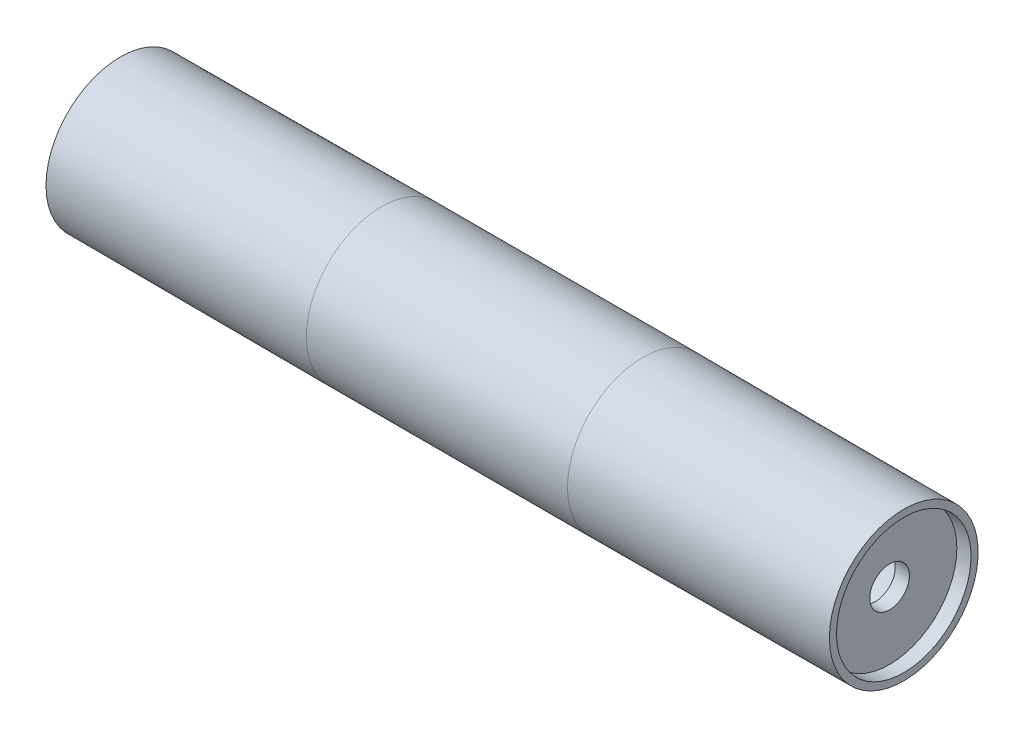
ISO-10303-21;
HEADER;
FILE_DESCRIPTION(('STEP AP214'),'2;1');
FILE_NAME('part.step','',(''),(''),'','','');
FILE_SCHEMA(('AUTOMOTIVE_DESIGN { 1 0 10303 214 1 1 1 1 }'));
ENDSEC;
DATA;
#1=APPLICATION_CONTEXT('core data for automotive mechanical design processes');
#2=APPLICATION_PROTOCOL_DEFINITION('international standard','automotive_design',2000,#1);
#3=PRODUCT_CONTEXT('',#1,'mechanical');
#4=PRODUCT('Part','Part','',(#3));
#5=PRODUCT_RELATED_PRODUCT_CATEGORY('part','',(#4));
#6=PRODUCT_DEFINITION_FORMATION('','',#4);
#7=PRODUCT_DEFINITION_CONTEXT('part definition',#1,'design');
#8=PRODUCT_DEFINITION('design','',#6,#7);
#9=PRODUCT_DEFINITION_SHAPE('','',#8);
#10=(LENGTH_UNIT() NAMED_UNIT(*) SI_UNIT(.MILLI.,.METRE.));
#11=(NAMED_UNIT(*) PLANE_ANGLE_UNIT() SI_UNIT($,.RADIAN.));
#12=(NAMED_UNIT(*) SI_UNIT($,.STERADIAN.) SOLID_ANGLE_UNIT());
#13=UNCERTAINTY_MEASURE_WITH_UNIT(LENGTH_MEASURE(1.E-05),#10,'distance_accuracy_value','');
#14=(GEOMETRIC_REPRESENTATION_CONTEXT(3) GLOBAL_UNCERTAINTY_ASSIGNED_CONTEXT((#13)) GLOBAL_UNIT_ASSIGNED_CONTEXT((#10,
#11,#12)) REPRESENTATION_CONTEXT('',''));
#15=CARTESIAN_POINT('',(0.,0.,0.));
#16=DIRECTION('',(0.,0.,1.));
#17=DIRECTION('',(1.,0.,0.));
#18=AXIS2_PLACEMENT_3D('',#15,#16,#17);
#19=CARTESIAN_POINT('',(-457.495284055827,0.,0.));
#20=DIRECTION('',(-1.,0.,0.));
#21=DIRECTION('',(0.,0.,1.));
#22=AXIS2_PLACEMENT_3D('',#19,#20,#21);
#23=CYLINDRICAL_SURFACE('',#22,118.5);
#24=CARTESIAN_POINT('',(-665.,0.,0.));
#25=DIRECTION('',(-1.,0.,0.));
#26=DIRECTION('',(0.,0.,1.));
#27=AXIS2_PLACEMENT_3D('',#24,#25,#26);
#28=CIRCLE('',#27,118.5);
#29=CARTESIAN_POINT('',(-665.,0.,118.5));
#30=VERTEX_POINT('',#29);
#31=EDGE_CURVE('E10',#30,#30,#28,.T.);
#32=ORIENTED_EDGE('',*,*,#31,.F.);
#33=EDGE_LOOP('',(#32));
#34=FACE_BOUND('',#33,.T.);
#35=CARTESIAN_POINT('',(-690.,0.,0.));
#36=DIRECTION('',(-1.,0.,0.));
#37=DIRECTION('',(0.,0.,1.));
#38=AXIS2_PLACEMENT_3D('',#35,#36,#37);
#39=CIRCLE('',#38,118.5);
#40=CARTESIAN_POINT('',(-690.,0.,118.5));
#41=VERTEX_POINT('',#40);
#42=EDGE_CURVE('E72',#41,#41,#39,.T.);
#43=ORIENTED_EDGE('',*,*,#42,.T.);
#44=EDGE_LOOP('',(#43));
#45=FACE_BOUND('',#44,.T.);
#46=ADVANCED_FACE('F34',(#34,#45),#23,.F.);
#47=CARTESIAN_POINT('',(230.,0.,0.));
#48=DIRECTION('',(-1.,0.,0.));
#49=DIRECTION('',(0.,0.,1.));
#50=AXIS2_PLACEMENT_3D('',#47,#48,#49);
#51=CONICAL_SURFACE('',#50,132.5,0.00326085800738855);
#52=CARTESIAN_POINT('',(690.,0.,0.));
#53=DIRECTION('',(-1.,0.,0.));
#54=DIRECTION('',(0.,0.,1.));
#55=AXIS2_PLACEMENT_3D('',#52,#53,#54);
#56=CIRCLE('',#55,131.);
#57=CARTESIAN_POINT('',(690.,0.,131.));
#58=VERTEX_POINT('',#57);
#59=EDGE_CURVE('E57',#58,#58,#56,.T.);
#60=ORIENTED_EDGE('',*,*,#59,.T.);
#61=EDGE_LOOP('',(#60));
#62=FACE_BOUND('',#61,.T.);
#63=CARTESIAN_POINT('',(230.,0.,0.));
#64=DIRECTION('',(-1.,0.,0.));
#65=DIRECTION('',(0.,0.,1.));
#66=AXIS2_PLACEMENT_3D('',#63,#64,#65);
#67=CIRCLE('',#66,132.5);
#68=CARTESIAN_POINT('',(230.,0.,132.5));
#69=VERTEX_POINT('',#68);
#70=EDGE_CURVE('E47',#69,#69,#67,.T.);
#71=ORIENTED_EDGE('',*,*,#70,.F.);
#72=EDGE_LOOP('',(#71));
#73=FACE_BOUND('',#72,.T.);
#74=ADVANCED_FACE('F36',(#62,#73),#51,.T.);
#75=CARTESIAN_POINT('',(-457.495284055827,0.,0.));
#76=DIRECTION('',(-1.,0.,0.));
#77=DIRECTION('',(0.,0.,1.));
#78=AXIS2_PLACEMENT_3D('',#75,#76,#77);
#79=CYLINDRICAL_SURFACE('',#78,132.5);
#80=ORIENTED_EDGE('',*,*,#70,.T.);
#81=EDGE_LOOP('',(#80));
#82=FACE_BOUND('',#81,.T.);
#83=CARTESIAN_POINT('',(-230.,0.,0.));
#84=DIRECTION('',(-1.,0.,0.));
#85=DIRECTION('',(0.,0.,1.));
#86=AXIS2_PLACEMENT_3D('',#83,#84,#85);
#87=CIRCLE('',#86,132.5);
#88=CARTESIAN_POINT('',(-230.,0.,132.5));
#89=VERTEX_POINT('',#88);
#90=EDGE_CURVE('E78',#89,#89,#87,.T.);
#91=ORIENTED_EDGE('',*,*,#90,.F.);
#92=EDGE_LOOP('',(#91));
#93=FACE_BOUND('',#92,.T.);
#94=ADVANCED_FACE('F84',(#82,#93),#79,.T.);
#95=CARTESIAN_POINT('',(-690.,0.,0.));
#96=DIRECTION('',(1.,0.,0.));
#97=DIRECTION('',(0.,0.,-1.));
#98=AXIS2_PLACEMENT_3D('',#95,#96,#97);
#99=CONICAL_SURFACE('',#98,131.,0.00326085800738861);
#100=ORIENTED_EDGE('',*,*,#90,.T.);
#101=EDGE_LOOP('',(#100));
#102=FACE_BOUND('',#101,.T.);
#103=CARTESIAN_POINT('',(-690.,0.,0.));
#104=DIRECTION('',(-1.,0.,0.));
#105=DIRECTION('',(0.,0.,1.));
#106=AXIS2_PLACEMENT_3D('',#103,#104,#105);
#107=CIRCLE('',#106,131.);
#108=CARTESIAN_POINT('',(-690.,0.,131.));
#109=VERTEX_POINT('',#108);
#110=EDGE_CURVE('E75',#109,#109,#107,.T.);
#111=ORIENTED_EDGE('',*,*,#110,.F.);
#112=EDGE_LOOP('',(#111));
#113=FACE_BOUND('',#112,.T.);
#114=ADVANCED_FACE('F93',(#102,#113),#99,.T.);
#115=CARTESIAN_POINT('',(-690.,-118.5,0.));
#116=DIRECTION('',(-1.,0.,0.));
#117=DIRECTION('',(0.,0.,1.));
#118=AXIS2_PLACEMENT_3D('',#115,#116,#117);
#119=PLANE('',#118);
#120=ORIENTED_EDGE('',*,*,#110,.T.);
#121=EDGE_LOOP('',(#120));
#122=FACE_BOUND('',#121,.T.);
#123=ORIENTED_EDGE('',*,*,#42,.F.);
#124=EDGE_LOOP('',(#123));
#125=FACE_BOUND('',#124,.T.);
#126=ADVANCED_FACE('F112',(#122,#125),#119,.T.);
#127=CARTESIAN_POINT('',(665.,0.,0.));
#128=DIRECTION('',(1.,0.,0.));
#129=DIRECTION('',(0.,0.,-1.));
#130=AXIS2_PLACEMENT_3D('',#127,#128,#129);
#131=CIRCLE('',#130,118.5);
#132=CARTESIAN_POINT('',(665.,0.,-118.5));
#133=VERTEX_POINT('',#132);
#134=EDGE_CURVE('E42',#133,#133,#131,.T.);
#135=ORIENTED_EDGE('',*,*,#134,.F.);
#136=EDGE_LOOP('',(#135));
#137=FACE_BOUND('',#136,.T.);
#138=CARTESIAN_POINT('',(690.,0.,0.));
#139=DIRECTION('',(-1.,0.,0.));
#140=DIRECTION('',(0.,0.,1.));
#141=AXIS2_PLACEMENT_3D('',#138,#139,#140);
#142=CIRCLE('',#141,118.5);
#143=CARTESIAN_POINT('',(690.,0.,118.5));
#144=VERTEX_POINT('',#143);
#145=EDGE_CURVE('E69',#144,#144,#142,.T.);
#146=ORIENTED_EDGE('',*,*,#145,.F.);
#147=EDGE_LOOP('',(#146));
#148=FACE_BOUND('',#147,.T.);
#149=ADVANCED_FACE('F96',(#137,#148),#23,.F.);
#150=CARTESIAN_POINT('',(690.,-118.5,0.));
#151=DIRECTION('',(1.,0.,0.));
#152=DIRECTION('',(0.,0.,-1.));
#153=AXIS2_PLACEMENT_3D('',#150,#151,#152);
#154=PLANE('',#153);
#155=ORIENTED_EDGE('',*,*,#145,.T.);
#156=EDGE_LOOP('',(#155));
#157=FACE_BOUND('',#156,.T.);
#158=ORIENTED_EDGE('',*,*,#59,.F.);
#159=EDGE_LOOP('',(#158));
#160=FACE_BOUND('',#159,.T.);
#161=ADVANCED_FACE('F100',(#157,#160),#154,.T.);
#162=CARTESIAN_POINT('',(665.,0.,0.));
#163=DIRECTION('',(1.,0.,0.));
#164=DIRECTION('',(0.,0.,-1.));
#165=AXIS2_PLACEMENT_3D('',#162,#163,#164);
#166=PLANE('',#165);
#167=CARTESIAN_POINT('',(665.,0.,0.));
#168=DIRECTION('',(1.,0.,0.));
#169=DIRECTION('',(0.,0.,-1.));
#170=AXIS2_PLACEMENT_3D('',#167,#168,#169);
#171=CIRCLE('',#170,35.);
#172=CARTESIAN_POINT('',(665.,0.,-35.));
#173=VERTEX_POINT('',#172);
#174=EDGE_CURVE('E215',#173,#173,#171,.T.);
#175=ORIENTED_EDGE('',*,*,#174,.F.);
#176=EDGE_LOOP('',(#175));
#177=FACE_BOUND('',#176,.T.);
#178=ORIENTED_EDGE('',*,*,#134,.T.);
#179=EDGE_LOOP('',(#178));
#180=FACE_BOUND('',#179,.T.);
#181=ADVANCED_FACE('F102',(#177,#180),#166,.T.);
#182=CARTESIAN_POINT('',(-665.,0.,0.));
#183=DIRECTION('',(-1.,0.,0.));
#184=DIRECTION('',(0.,0.,-1.));
#185=AXIS2_PLACEMENT_3D('',#182,#183,#184);
#186=PLANE('',#185);
#187=CARTESIAN_POINT('',(-665.,0.,0.));
#188=DIRECTION('',(-1.,0.,0.));
#189=DIRECTION('',(0.,0.,1.));
#190=AXIS2_PLACEMENT_3D('',#187,#188,#189);
#191=CIRCLE('',#190,35.);
#192=CARTESIAN_POINT('',(-665.,0.,35.));
#193=VERTEX_POINT('',#192);
#194=EDGE_CURVE('E53',#193,#193,#191,.T.);
#195=ORIENTED_EDGE('',*,*,#194,.F.);
#196=EDGE_LOOP('',(#195));
#197=FACE_BOUND('',#196,.T.);
#198=ORIENTED_EDGE('',*,*,#31,.T.);
#199=EDGE_LOOP('',(#198));
#200=FACE_BOUND('',#199,.T.);
#201=ADVANCED_FACE('F109',(#197,#200),#186,.T.);
#202=CARTESIAN_POINT('',(-690.,0.,0.));
#203=DIRECTION('',(1.,0.,0.));
#204=DIRECTION('',(0.,0.,-1.));
#205=AXIS2_PLACEMENT_3D('',#202,#203,#204);
#206=CYLINDRICAL_SURFACE('',#205,35.);
#207=ORIENTED_EDGE('',*,*,#194,.T.);
#208=EDGE_LOOP('',(#207));
#209=FACE_BOUND('',#208,.T.);
#210=CARTESIAN_POINT('',(-640.,0.,0.));
#211=DIRECTION('',(-1.,0.,0.));
#212=DIRECTION('',(0.,0.,1.));
#213=AXIS2_PLACEMENT_3D('',#210,#211,#212);
#214=CIRCLE('',#213,35.);
#215=CARTESIAN_POINT('',(-640.,0.,35.));
#216=VERTEX_POINT('',#215);
#217=EDGE_CURVE('E38',#216,#216,#214,.T.);
#218=ORIENTED_EDGE('',*,*,#217,.F.);
#219=EDGE_LOOP('',(#218));
#220=FACE_BOUND('',#219,.T.);
#221=ADVANCED_FACE('F175',(#209,#220),#206,.F.);
#222=ORIENTED_EDGE('',*,*,#174,.T.);
#223=EDGE_LOOP('',(#222));
#224=FACE_BOUND('',#223,.T.);
#225=CARTESIAN_POINT('',(640.,0.,0.));
#226=DIRECTION('',(1.,0.,0.));
#227=DIRECTION('',(0.,0.,-1.));
#228=AXIS2_PLACEMENT_3D('',#225,#226,#227);
#229=CIRCLE('',#228,35.);
#230=CARTESIAN_POINT('',(640.,0.,-35.));
#231=VERTEX_POINT('',#230);
#232=EDGE_CURVE('E59',#231,#231,#229,.T.);
#233=ORIENTED_EDGE('',*,*,#232,.F.);
#234=EDGE_LOOP('',(#233));
#235=FACE_BOUND('',#234,.T.);
#236=ADVANCED_FACE('F186',(#224,#235),#206,.F.);
#237=CARTESIAN_POINT('',(640.,0.,0.));
#238=DIRECTION('',(1.,0.,0.));
#239=DIRECTION('',(0.,0.,-1.));
#240=AXIS2_PLACEMENT_3D('',#237,#238,#239);
#241=PLANE('',#240);
#242=ORIENTED_EDGE('',*,*,#232,.T.);
#243=EDGE_LOOP('',(#242));
#244=FACE_BOUND('',#243,.T.);
#245=CARTESIAN_POINT('',(640.,0.,0.));
#246=DIRECTION('',(1.,0.,0.));
#247=DIRECTION('',(0.,0.,-1.));
#248=AXIS2_PLACEMENT_3D('',#245,#246,#247);
#249=CIRCLE('',#248,118.5);
#250=CARTESIAN_POINT('',(640.,0.,-118.5));
#251=VERTEX_POINT('',#250);
#252=EDGE_CURVE('E50',#251,#251,#249,.T.);
#253=ORIENTED_EDGE('',*,*,#252,.F.);
#254=EDGE_LOOP('',(#253));
#255=FACE_BOUND('',#254,.T.);
#256=ADVANCED_FACE('F115',(#244,#255),#241,.F.);
#257=ORIENTED_EDGE('',*,*,#252,.T.);
#258=EDGE_LOOP('',(#257));
#259=FACE_BOUND('',#258,.T.);
#260=CARTESIAN_POINT('',(-640.,0.,0.));
#261=DIRECTION('',(-1.,0.,0.));
#262=DIRECTION('',(0.,0.,1.));
#263=AXIS2_PLACEMENT_3D('',#260,#261,#262);
#264=CIRCLE('',#263,118.5);
#265=CARTESIAN_POINT('',(-640.,0.,118.5));
#266=VERTEX_POINT('',#265);
#267=EDGE_CURVE('E51',#266,#266,#264,.T.);
#268=ORIENTED_EDGE('',*,*,#267,.T.);
#269=EDGE_LOOP('',(#268));
#270=FACE_BOUND('',#269,.T.);
#271=ADVANCED_FACE('F97',(#259,#270),#23,.F.);
#272=CARTESIAN_POINT('',(-640.,0.,0.));
#273=DIRECTION('',(-1.,0.,0.));
#274=DIRECTION('',(0.,0.,-1.));
#275=AXIS2_PLACEMENT_3D('',#272,#273,#274);
#276=PLANE('',#275);
#277=ORIENTED_EDGE('',*,*,#217,.T.);
#278=EDGE_LOOP('',(#277));
#279=FACE_BOUND('',#278,.T.);
#280=ORIENTED_EDGE('',*,*,#267,.F.);
#281=EDGE_LOOP('',(#280));
#282=FACE_BOUND('',#281,.T.);
#283=ADVANCED_FACE('F158',(#279,#282),#276,.F.);
#284=CLOSED_SHELL('',(#46,#74,#94,#114,#126,#149,#161,#181,#201,#221,#236,#256,#271,#283));
#285=MANIFOLD_SOLID_BREP('B2',#284);
#286=ADVANCED_BREP_SHAPE_REPRESENTATION('',(#18,#285),#14);
#287=SHAPE_DEFINITION_REPRESENTATION(#9,#286);
ENDSEC;
END-ISO-10303-21;
